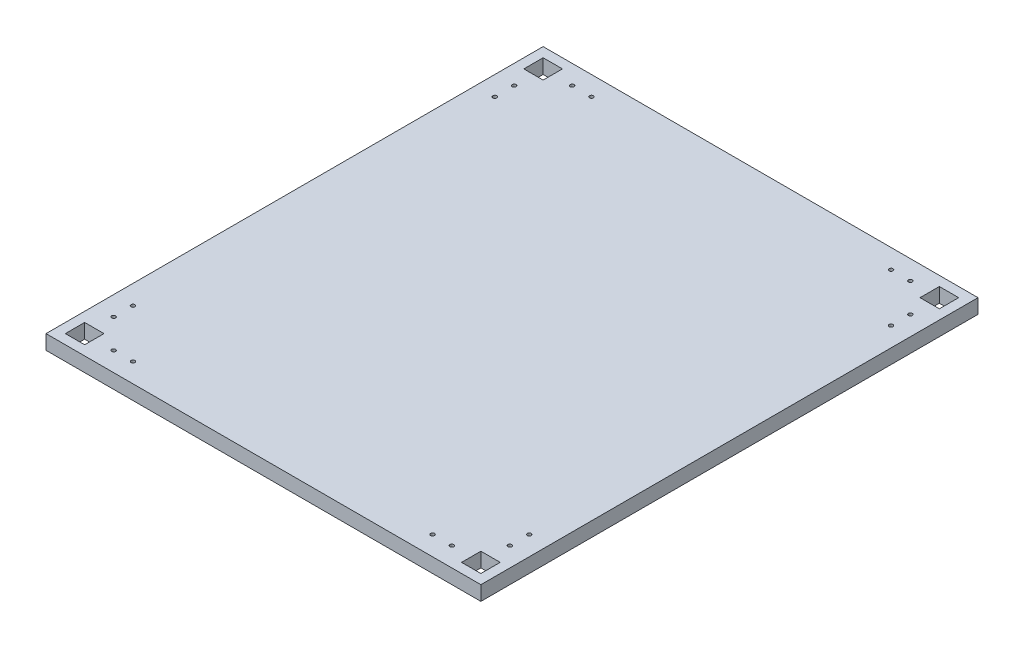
from build123d import *

# Parameters (mm, degrees)
SKETCH1_W           = 450
SKETCH1_H           = 514.4
BOSS_EXTRUDE1_DEPTH = 15
SKETCH2_W           = 20
SKETCH2_H           = 20
CUT_EXTRUDE1_DEPTH  = 15
SKETCH3_R           = 2
CUT_EXTRUDE2_DEPTH  = 343.055317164


with BuildPart() as part:
    # Sketch1 → Boss-Extrude1 (new body)
    with BuildSketch(Plane(origin=(0, 0, 0), x_dir=(1, 0, 0), z_dir=(0, 1, 0))):
        Rectangle(SKETCH1_W, SKETCH1_H)
    extrude(amount=BOSS_EXTRUDE1_DEPTH)

    # Sketch2 → Cut-Extrude1 (cut)
    with BuildSketch(Plane(origin=(0, 15, 0), x_dir=(1, 0, 0), z_dir=(0, 1, 0))):
        with Locations((205, 237.2)):
            Rectangle(SKETCH2_W, SKETCH2_H)
        with Locations((-205, 237.2)):
            Rectangle(SKETCH2_W, SKETCH2_H)
        with Locations((-205, -237.2)):
            Rectangle(SKETCH2_W, SKETCH2_H)
        with Locations((205, -237.2)):
            Rectangle(SKETCH2_W, SKETCH2_H)
    extrude(amount=-CUT_EXTRUDE1_DEPTH, mode=Mode.SUBTRACT)

    # Sketch3 → Cut-Extrude2 (cut, through all)
    with BuildSketch(Plane(origin=(0, 15, 0), x_dir=(1, 0, 0), z_dir=(0, 1, 0))):
        with Locations(Location((-175, 237.2, 0), (0, 0, 270))):
            Circle(SKETCH3_R)
        with Locations(Location((-155, 237.2, 0), (0, 0, 270))):
            Circle(SKETCH3_R)
        with Locations(Location((-205, 207.2, 0), (0, 0, 270))):
            Circle(SKETCH3_R)
        with Locations(Location((-205, 187.2, 0), (0, 0, 270))):
            Circle(SKETCH3_R)
        with Locations(Location((205, 187.2, 0), (0, 0, 90))):
            Circle(SKETCH3_R)
        with Locations(Location((205, 207.2, 0), (0, 0, 90))):
            Circle(SKETCH3_R)
        with Locations(Location((155, 237.2, 0), (0, 0, 90))):
            Circle(SKETCH3_R)
        with Locations(Location((175, 237.2, 0), (0, 0, 90))):
            Circle(SKETCH3_R)
        with Locations(Location((175, -237.2, 0), (0, 0, 270))):
            Circle(SKETCH3_R)
        with Locations(Location((155, -237.2, 0), (0, 0, 270))):
            Circle(SKETCH3_R)
        with Locations(Location((205, -207.2, 0), (0, 0, 270))):
            Circle(SKETCH3_R)
        with Locations(Location((205, -187.2, 0), (0, 0, 270))):
            Circle(SKETCH3_R)
        with Locations(Location((-205, -187.2, 0), (0, 0, 90))):
            Circle(SKETCH3_R)
        with Locations(Location((-205, -207.2, 0), (0, 0, 90))):
            Circle(SKETCH3_R)
        with Locations(Location((-155, -237.2, 0), (0, 0, 90))):
            Circle(SKETCH3_R)
        with Locations(Location((-175, -237.2, 0), (0, 0, 90))):
            Circle(SKETCH3_R)
    extrude(amount=-CUT_EXTRUDE2_DEPTH, mode=Mode.SUBTRACT)


solid = part.part
